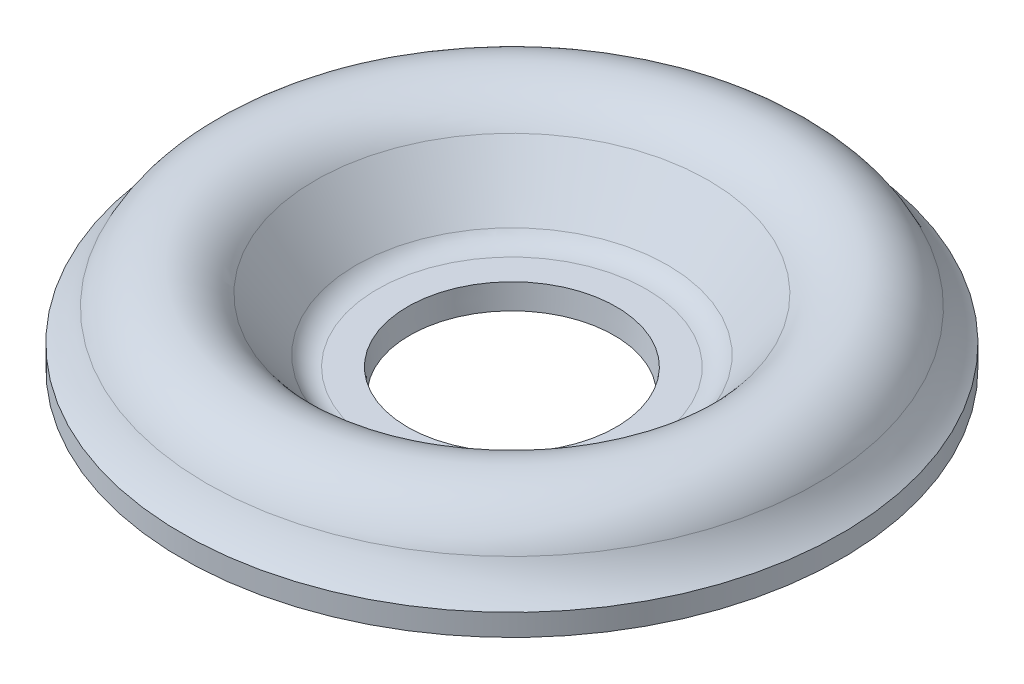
ISO-10303-21;
HEADER;
FILE_DESCRIPTION(('STEP AP214'),'2;1');
FILE_NAME('part.step','',(''),(''),'','','');
FILE_SCHEMA(('AUTOMOTIVE_DESIGN { 1 0 10303 214 1 1 1 1 }'));
ENDSEC;
DATA;
#1=APPLICATION_CONTEXT('core data for automotive mechanical design processes');
#2=APPLICATION_PROTOCOL_DEFINITION('international standard','automotive_design',2000,#1);
#3=PRODUCT_CONTEXT('',#1,'mechanical');
#4=PRODUCT('Part','Part','',(#3));
#5=PRODUCT_RELATED_PRODUCT_CATEGORY('part','',(#4));
#6=PRODUCT_DEFINITION_FORMATION('','',#4);
#7=PRODUCT_DEFINITION_CONTEXT('part definition',#1,'design');
#8=PRODUCT_DEFINITION('design','',#6,#7);
#9=PRODUCT_DEFINITION_SHAPE('','',#8);
#10=(LENGTH_UNIT() NAMED_UNIT(*) SI_UNIT(.MILLI.,.METRE.));
#11=(NAMED_UNIT(*) PLANE_ANGLE_UNIT() SI_UNIT($,.RADIAN.));
#12=(NAMED_UNIT(*) SI_UNIT($,.STERADIAN.) SOLID_ANGLE_UNIT());
#13=UNCERTAINTY_MEASURE_WITH_UNIT(LENGTH_MEASURE(1.E-05),#10,'distance_accuracy_value','');
#14=(GEOMETRIC_REPRESENTATION_CONTEXT(3) GLOBAL_UNCERTAINTY_ASSIGNED_CONTEXT((#13)) GLOBAL_UNIT_ASSIGNED_CONTEXT((#10,
#11,#12)) REPRESENTATION_CONTEXT('',''));
#15=CARTESIAN_POINT('',(0.,0.,0.));
#16=DIRECTION('',(0.,0.,1.));
#17=DIRECTION('',(1.,0.,0.));
#18=AXIS2_PLACEMENT_3D('',#15,#16,#17);
#19=CARTESIAN_POINT('',(-1.638017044E-13,-3.32281798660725,0.));
#20=DIRECTION('',(0.,-1.,0.));
#21=DIRECTION('',(0.,0.,-1.));
#22=AXIS2_PLACEMENT_3D('',#19,#20,#21);
#23=TOROIDAL_SURFACE('',#22,13.1406157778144,5.20700000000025);
#24=CARTESIAN_POINT('',(-1.638017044E-13,-8.52981798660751,0.));
#25=DIRECTION('',(0.,1.,0.));
#26=DIRECTION('',(0.,0.,-1.));
#27=AXIS2_PLACEMENT_3D('',#24,#25,#26);
#28=CIRCLE('',#27,13.1406157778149);
#29=CARTESIAN_POINT('',(-1.67020227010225E-13,-8.52981798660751,-13.1406157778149));
#30=VERTEX_POINT('',#29);
#31=EDGE_CURVE('E131',#30,#30,#28,.F.);
#32=ORIENTED_EDGE('',*,*,#31,.F.);
#33=EDGE_LOOP('',(#32));
#34=FACE_BOUND('',#33,.T.);
#35=CARTESIAN_POINT('',(-1.638017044E-13,-6.50366272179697,0.));
#36=DIRECTION('',(0.,1.,0.));
#37=DIRECTION('',(0.,0.,1.));
#38=AXIS2_PLACEMENT_3D('',#35,#36,#37);
#39=CIRCLE('',#38,17.2631242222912);
#40=CARTESIAN_POINT('',(-1.638017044E-13,-6.50366272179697,17.2631242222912));
#41=VERTEX_POINT('',#40);
#42=EDGE_CURVE('E123',#41,#41,#39,.T.);
#43=ORIENTED_EDGE('',*,*,#42,.F.);
#44=EDGE_LOOP('',(#43));
#45=FACE_BOUND('',#44,.T.);
#46=ADVANCED_FACE('F14',(#34,#45),#23,.T.);
#47=CARTESIAN_POINT('',(-1.638017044E-13,-1.86311536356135,0.));
#48=DIRECTION('',(0.,1.,0.));
#49=DIRECTION('',(0.,0.,1.));
#50=AXIS2_PLACEMENT_3D('',#47,#48,#49);
#51=CONICAL_SURFACE('',#50,20.8436773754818,0.657169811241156);
#52=CARTESIAN_POINT('',(-1.638017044E-13,-1.86311536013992,0.));
#53=DIRECTION('',(0.,-1.,0.));
#54=DIRECTION('',(0.,0.,-1.));
#55=AXIS2_PLACEMENT_3D('',#52,#53,#54);
#56=CIRCLE('',#55,20.8436773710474);
#57=CARTESIAN_POINT('',(-1.638017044E-13,-1.86311536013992,-20.8436773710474));
#58=VERTEX_POINT('',#57);
#59=EDGE_CURVE('E106',#58,#58,#56,.T.);
#60=ORIENTED_EDGE('',*,*,#59,.T.);
#61=EDGE_LOOP('',(#60));
#62=FACE_BOUND('',#61,.T.);
#63=ORIENTED_EDGE('',*,*,#42,.T.);
#64=EDGE_LOOP('',(#63));
#65=FACE_BOUND('',#64,.T.);
#66=ADVANCED_FACE('F115',(#62,#65),#51,.T.);
#67=CARTESIAN_POINT('',(-1.638017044E-13,-8.52981798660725,-9.74090000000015));
#68=DIRECTION('',(0.,-1.,0.));
#69=DIRECTION('',(0.,0.,-1.));
#70=AXIS2_PLACEMENT_3D('',#67,#68,#69);
#71=PLANE('',#70);
#72=CARTESIAN_POINT('',(-1.638017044E-13,-8.52981798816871,0.));
#73=DIRECTION('',(0.,1.,0.));
#74=DIRECTION('',(0.,0.,1.));
#75=AXIS2_PLACEMENT_3D('',#72,#73,#74);
#76=CIRCLE('',#75,9.74090001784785);
#77=CARTESIAN_POINT('',(-1.638017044E-13,-8.52981798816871,9.74090001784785));
#78=VERTEX_POINT('',#77);
#79=EDGE_CURVE('E19',#78,#78,#76,.T.);
#80=ORIENTED_EDGE('',*,*,#79,.T.);
#81=EDGE_LOOP('',(#80));
#82=FACE_BOUND('',#81,.T.);
#83=ORIENTED_EDGE('',*,*,#31,.T.);
#84=EDGE_LOOP('',(#83));
#85=FACE_BOUND('',#84,.T.);
#86=ADVANCED_FACE('F111',(#82,#85),#71,.T.);
#87=CARTESIAN_POINT('',(-1.638017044E-13,-3.95781798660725,0.));
#88=DIRECTION('',(0.,-1.,0.));
#89=DIRECTION('',(0.,0.,-1.));
#90=AXIS2_PLACEMENT_3D('',#87,#88,#89);
#91=TOROIDAL_SURFACE('',#90,23.5585000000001,3.42900000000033);
#92=CARTESIAN_POINT('',(-1.638017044E-13,-2.49426163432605,0.));
#93=DIRECTION('',(0.,-1.,0.));
#94=DIRECTION('',(0.,0.,-1.));
#95=AXIS2_PLACEMENT_3D('',#92,#93,#94);
#96=CIRCLE('',#95,26.6594746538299);
#97=CARTESIAN_POINT('',(-1.638017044E-13,-2.49426163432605,-26.6594746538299));
#98=VERTEX_POINT('',#97);
#99=EDGE_CURVE('E98',#98,#98,#96,.F.);
#100=ORIENTED_EDGE('',*,*,#99,.F.);
#101=EDGE_LOOP('',(#100));
#102=FACE_BOUND('',#101,.T.);
#103=ORIENTED_EDGE('',*,*,#59,.F.);
#104=EDGE_LOOP('',(#103));
#105=FACE_BOUND('',#104,.T.);
#106=ADVANCED_FACE('F108',(#102,#105),#91,.F.);
#107=CARTESIAN_POINT('',(-1.638017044E-13,-6.26921798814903,0.));
#108=DIRECTION('',(0.,1.,0.));
#109=DIRECTION('',(0.,0.,1.));
#110=AXIS2_PLACEMENT_3D('',#107,#108,#109);
#111=CONICAL_SURFACE('',#110,9.93867689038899,0.0872664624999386);
#112=CARTESIAN_POINT('',(-1.638017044E-13,-6.269217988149,0.));
#113=DIRECTION('',(0.,1.,0.));
#114=DIRECTION('',(0.,0.,1.));
#115=AXIS2_PLACEMENT_3D('',#112,#113,#114);
#116=CIRCLE('',#115,9.93867689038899);
#117=CARTESIAN_POINT('',(-1.638017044E-13,-6.269217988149,9.93867689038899));
#118=VERTEX_POINT('',#117);
#119=EDGE_CURVE('E101',#118,#118,#116,.T.);
#120=ORIENTED_EDGE('',*,*,#119,.T.);
#121=EDGE_LOOP('',(#120));
#122=FACE_BOUND('',#121,.T.);
#123=ORIENTED_EDGE('',*,*,#79,.F.);
#124=EDGE_LOOP('',(#123));
#125=FACE_BOUND('',#124,.T.);
#126=ADVANCED_FACE('F91',(#122,#125),#111,.F.);
#127=CARTESIAN_POINT('',(-1.638017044E-13,2.24874506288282,0.));
#128=DIRECTION('',(0.,-1.,0.));
#129=DIRECTION('',(0.,0.,-1.));
#130=AXIS2_PLACEMENT_3D('',#127,#128,#129);
#131=TOROIDAL_SURFACE('',#130,36.7089295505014,11.1125000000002);
#132=ORIENTED_EDGE('',*,*,#99,.T.);
#133=EDGE_LOOP('',(#132));
#134=FACE_BOUND('',#133,.T.);
#135=CARTESIAN_POINT('',(-1.638017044E-13,-6.39349443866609,0.));
#136=DIRECTION('',(0.,-1.,0.));
#137=DIRECTION('',(0.,0.,-1.));
#138=AXIS2_PLACEMENT_3D('',#135,#136,#137);
#139=CIRCLE('',#138,29.7232762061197);
#140=CARTESIAN_POINT('',(-1.638017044E-13,-6.39349443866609,-29.7232762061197));
#141=VERTEX_POINT('',#140);
#142=EDGE_CURVE('E150',#141,#141,#139,.F.);
#143=ORIENTED_EDGE('',*,*,#142,.F.);
#144=EDGE_LOOP('',(#143));
#145=FACE_BOUND('',#144,.T.);
#146=ADVANCED_FACE('F86',(#134,#145),#131,.T.);
#147=CARTESIAN_POINT('',(-1.638017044E-13,-6.2692179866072,-9.93867687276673));
#148=DIRECTION('',(0.,-1.,0.));
#149=DIRECTION('',(0.,0.,-1.));
#150=AXIS2_PLACEMENT_3D('',#147,#148,#149);
#151=PLANE('',#150);
#152=ORIENTED_EDGE('',*,*,#119,.F.);
#153=EDGE_LOOP('',(#152));
#154=FACE_BOUND('',#153,.T.);
#155=CARTESIAN_POINT('',(-1.638017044E-13,-6.26921798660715,0.));
#156=DIRECTION('',(0.,-1.,0.));
#157=DIRECTION('',(0.,0.,-1.));
#158=AXIS2_PLACEMENT_3D('',#155,#156,#157);
#159=CIRCLE('',#158,12.8270000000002);
#160=CARTESIAN_POINT('',(-1.638017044E-13,-6.26921798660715,-12.8270000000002));
#161=VERTEX_POINT('',#160);
#162=EDGE_CURVE('E73',#161,#161,#159,.F.);
#163=ORIENTED_EDGE('',*,*,#162,.T.);
#164=EDGE_LOOP('',(#163));
#165=FACE_BOUND('',#164,.T.);
#166=ADVANCED_FACE('F77',(#154,#165),#151,.F.);
#167=CARTESIAN_POINT('',(-1.638017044E-13,-6.39349443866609,-29.7232762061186));
#168=DIRECTION('',(0.,-1.,0.));
#169=DIRECTION('',(0.,0.,-1.));
#170=AXIS2_PLACEMENT_3D('',#167,#168,#169);
#171=PLANE('',#170);
#172=ORIENTED_EDGE('',*,*,#142,.T.);
#173=EDGE_LOOP('',(#172));
#174=FACE_BOUND('',#173,.T.);
#175=CARTESIAN_POINT('',(-1.638017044E-13,-6.3934944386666,0.));
#176=DIRECTION('',(0.,-1.,0.));
#177=DIRECTION('',(0.,0.,-1.));
#178=AXIS2_PLACEMENT_3D('',#175,#176,#177);
#179=CIRCLE('',#178,31.3998557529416);
#180=CARTESIAN_POINT('',(-1.638017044E-13,-6.3934944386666,-31.3998557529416));
#181=VERTEX_POINT('',#180);
#182=EDGE_CURVE('E141',#181,#181,#179,.F.);
#183=ORIENTED_EDGE('',*,*,#182,.F.);
#184=EDGE_LOOP('',(#183));
#185=FACE_BOUND('',#184,.T.);
#186=ADVANCED_FACE('F60',(#174,#185),#171,.T.);
#187=CARTESIAN_POINT('',(-1.638017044E-13,-3.72921798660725,0.));
#188=DIRECTION('',(0.,-1.,0.));
#189=DIRECTION('',(0.,0.,-1.));
#190=AXIS2_PLACEMENT_3D('',#187,#188,#189);
#191=TOROIDAL_SURFACE('',#190,12.8270000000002,2.5399999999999);
#192=ORIENTED_EDGE('',*,*,#162,.F.);
#193=EDGE_LOOP('',(#192));
#194=FACE_BOUND('',#193,.T.);
#195=CARTESIAN_POINT('',(-1.638017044E-13,-5.28084956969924,0.));
#196=DIRECTION('',(0.,1.,0.));
#197=DIRECTION('',(0.,0.,1.));
#198=AXIS2_PLACEMENT_3D('',#195,#196,#197);
#199=CIRCLE('',#198,14.8379797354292);
#200=CARTESIAN_POINT('',(-1.638017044E-13,-5.28084956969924,14.8379797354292));
#201=VERTEX_POINT('',#200);
#202=EDGE_CURVE('E149',#201,#201,#199,.T.);
#203=ORIENTED_EDGE('',*,*,#202,.T.);
#204=EDGE_LOOP('',(#203));
#205=FACE_BOUND('',#204,.T.);
#206=ADVANCED_FACE('F54',(#194,#205),#191,.F.);
#207=CARTESIAN_POINT('',(-1.638017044E-13,0.,0.));
#208=DIRECTION('',(0.,-1.,0.));
#209=DIRECTION('',(0.,0.,-1.));
#210=AXIS2_PLACEMENT_3D('',#207,#208,#209);
#211=CYLINDRICAL_SURFACE('',#210,31.3998557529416);
#212=ORIENTED_EDGE('',*,*,#182,.T.);
#213=EDGE_LOOP('',(#212));
#214=FACE_BOUND('',#213,.T.);
#215=CARTESIAN_POINT('',(-1.638017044E-13,-4.31932882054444,0.));
#216=DIRECTION('',(0.,-1.,0.));
#217=DIRECTION('',(0.,0.,-1.));
#218=AXIS2_PLACEMENT_3D('',#215,#216,#217);
#219=CIRCLE('',#218,31.3998557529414);
#220=CARTESIAN_POINT('',(-1.638017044E-13,-4.31932882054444,-31.3998557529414));
#221=VERTEX_POINT('',#220);
#222=EDGE_CURVE('E28',#221,#221,#219,.T.);
#223=ORIENTED_EDGE('',*,*,#222,.T.);
#224=EDGE_LOOP('',(#223));
#225=FACE_BOUND('',#224,.T.);
#226=ADVANCED_FACE('F50',(#214,#225),#211,.T.);
#227=CARTESIAN_POINT('',(-1.638017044E-13,-0.233880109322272,0.));
#228=DIRECTION('',(0.,1.,0.));
#229=DIRECTION('',(-1.,0.,0.));
#230=AXIS2_PLACEMENT_3D('',#227,#228,#229);
#231=CONICAL_SURFACE('',#230,18.7321200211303,0.657169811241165);
#232=CARTESIAN_POINT('',(-1.638017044E-13,-0.233880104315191,0.));
#233=DIRECTION('',(0.,-1.,0.));
#234=DIRECTION('',(0.,0.,-1.));
#235=AXIS2_PLACEMENT_3D('',#232,#233,#234);
#236=CIRCLE('',#235,18.732120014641);
#237=CARTESIAN_POINT('',(-1.638017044E-13,-0.233880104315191,-18.732120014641));
#238=VERTEX_POINT('',#237);
#239=EDGE_CURVE('E23',#238,#238,#236,.T.);
#240=ORIENTED_EDGE('',*,*,#239,.F.);
#241=EDGE_LOOP('',(#240));
#242=FACE_BOUND('',#241,.T.);
#243=ORIENTED_EDGE('',*,*,#202,.F.);
#244=EDGE_LOOP('',(#243));
#245=FACE_BOUND('',#244,.T.);
#246=ADVANCED_FACE('F46',(#242,#245),#231,.F.);
#247=CARTESIAN_POINT('',(-1.638017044E-13,2.24874506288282,0.));
#248=DIRECTION('',(0.,-1.,0.));
#249=DIRECTION('',(0.,0.,-1.));
#250=AXIS2_PLACEMENT_3D('',#247,#248,#249);
#251=TOROIDAL_SURFACE('',#250,36.7089295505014,8.44546381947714);
#252=CARTESIAN_POINT('',(-1.638017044E-13,-1.35592458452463,0.));
#253=DIRECTION('',(0.,-1.,0.));
#254=DIRECTION('',(0.,0.,-1.));
#255=AXIS2_PLACEMENT_3D('',#252,#253,#254);
#256=CIRCLE('',#255,29.0713765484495);
#257=CARTESIAN_POINT('',(-1.638017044E-13,-1.35592458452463,-29.0713765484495));
#258=VERTEX_POINT('',#257);
#259=EDGE_CURVE('E10',#258,#258,#256,.F.);
#260=ORIENTED_EDGE('',*,*,#259,.F.);
#261=EDGE_LOOP('',(#260));
#262=FACE_BOUND('',#261,.T.);
#263=ORIENTED_EDGE('',*,*,#222,.F.);
#264=EDGE_LOOP('',(#263));
#265=FACE_BOUND('',#264,.T.);
#266=ADVANCED_FACE('F41',(#262,#265),#251,.F.);
#267=CARTESIAN_POINT('',(-1.638017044E-13,-3.95781798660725,0.));
#268=DIRECTION('',(0.,-1.,0.));
#269=DIRECTION('',(0.,0.,-1.));
#270=AXIS2_PLACEMENT_3D('',#267,#268,#269);
#271=TOROIDAL_SURFACE('',#270,23.5585000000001,6.09603618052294);
#272=ORIENTED_EDGE('',*,*,#259,.T.);
#273=EDGE_LOOP('',(#272));
#274=FACE_BOUND('',#273,.T.);
#275=ORIENTED_EDGE('',*,*,#239,.T.);
#276=EDGE_LOOP('',(#275));
#277=FACE_BOUND('',#276,.T.);
#278=ADVANCED_FACE('F45',(#274,#277),#271,.T.);
#279=CLOSED_SHELL('',(#46,#66,#86,#106,#126,#146,#166,#186,#206,#226,#246,#266,#278));
#280=MANIFOLD_SOLID_BREP('B1',#279);
#281=ADVANCED_BREP_SHAPE_REPRESENTATION('',(#18,#280),#14);
#282=SHAPE_DEFINITION_REPRESENTATION(#9,#281);
ENDSEC;
END-ISO-10303-21;
